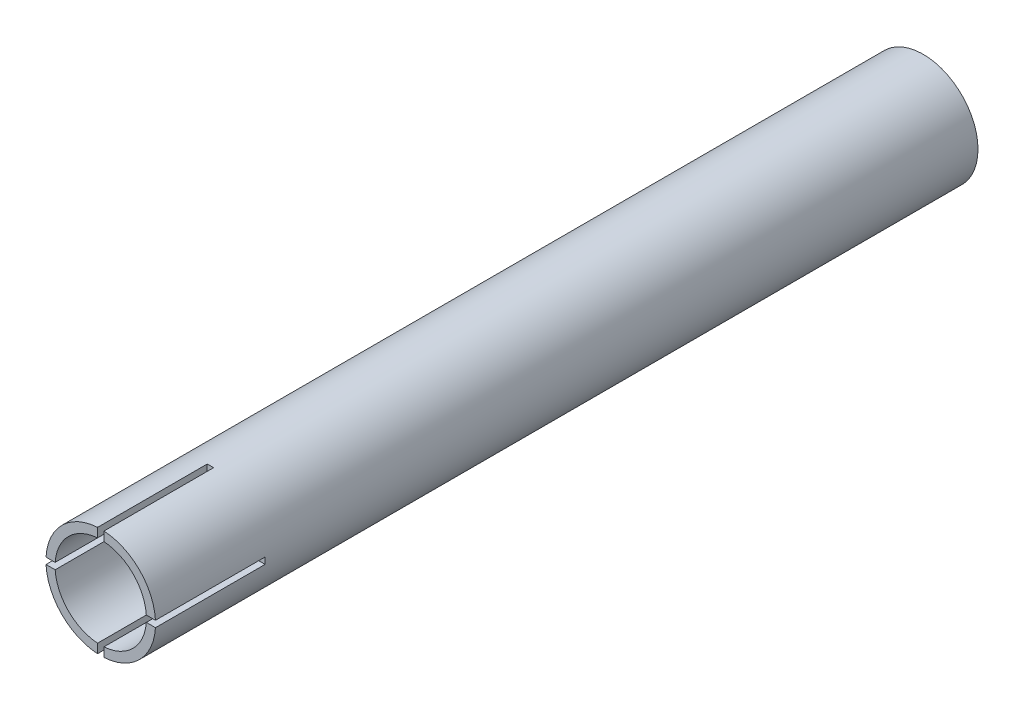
ISO-10303-21;
HEADER;
FILE_DESCRIPTION(('STEP AP214'),'2;1');
FILE_NAME('part.step','',(''),(''),'','','');
FILE_SCHEMA(('AUTOMOTIVE_DESIGN { 1 0 10303 214 1 1 1 1 }'));
ENDSEC;
DATA;
#1=APPLICATION_CONTEXT('core data for automotive mechanical design processes');
#2=APPLICATION_PROTOCOL_DEFINITION('international standard','automotive_design',2000,#1);
#3=PRODUCT_CONTEXT('',#1,'mechanical');
#4=PRODUCT('Part','Part','',(#3));
#5=PRODUCT_RELATED_PRODUCT_CATEGORY('part','',(#4));
#6=PRODUCT_DEFINITION_FORMATION('','',#4);
#7=PRODUCT_DEFINITION_CONTEXT('part definition',#1,'design');
#8=PRODUCT_DEFINITION('design','',#6,#7);
#9=PRODUCT_DEFINITION_SHAPE('','',#8);
#10=(LENGTH_UNIT() NAMED_UNIT(*) SI_UNIT(.MILLI.,.METRE.));
#11=(NAMED_UNIT(*) PLANE_ANGLE_UNIT() SI_UNIT($,.RADIAN.));
#12=(NAMED_UNIT(*) SI_UNIT($,.STERADIAN.) SOLID_ANGLE_UNIT());
#13=UNCERTAINTY_MEASURE_WITH_UNIT(LENGTH_MEASURE(1.E-05),#10,'distance_accuracy_value','');
#14=(GEOMETRIC_REPRESENTATION_CONTEXT(3) GLOBAL_UNCERTAINTY_ASSIGNED_CONTEXT((#13)) GLOBAL_UNIT_ASSIGNED_CONTEXT((#10,
#11,#12)) REPRESENTATION_CONTEXT('',''));
#15=CARTESIAN_POINT('',(0.,0.,0.));
#16=DIRECTION('',(0.,0.,1.));
#17=DIRECTION('',(1.,0.,0.));
#18=AXIS2_PLACEMENT_3D('',#15,#16,#17);
#19=CARTESIAN_POINT('',(0.,0.,90.));
#20=DIRECTION('',(0.,0.,1.));
#21=DIRECTION('',(1.,0.,0.));
#22=AXIS2_PLACEMENT_3D('',#19,#20,#21);
#23=PLANE('',#22);
#24=DIRECTION('',(0.,1.,0.));
#25=VECTOR('',#24,1.);
#26=CARTESIAN_POINT('',(0.350000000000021,6.04127326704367,90.));
#27=LINE('',#26,#25);
#28=CARTESIAN_POINT('',(0.350000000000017,4.98773495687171,90.));
#29=VERTEX_POINT('',#28);
#30=CARTESIAN_POINT('',(0.350000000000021,5.98978296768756,90.));
#31=VERTEX_POINT('',#30);
#32=EDGE_CURVE('E175',#29,#31,#27,.T.);
#33=ORIENTED_EDGE('',*,*,#32,.F.);
#34=CARTESIAN_POINT('',(0.,0.,90.));
#35=DIRECTION('',(0.,0.,1.));
#36=DIRECTION('',(1.,0.,0.));
#37=AXIS2_PLACEMENT_3D('',#34,#35,#36);
#38=CIRCLE('',#37,5.);
#39=CARTESIAN_POINT('',(4.98773495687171,0.35,90.));
#40=VERTEX_POINT('',#39);
#41=EDGE_CURVE('E294',#40,#29,#38,.T.);
#42=ORIENTED_EDGE('',*,*,#41,.F.);
#43=DIRECTION('',(-1.,0.,0.));
#44=VECTOR('',#43,1.);
#45=CARTESIAN_POINT('',(6.04127326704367,0.35,90.));
#46=LINE('',#45,#44);
#47=CARTESIAN_POINT('',(5.98978296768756,0.35,90.));
#48=VERTEX_POINT('',#47);
#49=EDGE_CURVE('E195',#48,#40,#46,.T.);
#50=ORIENTED_EDGE('',*,*,#49,.F.);
#51=CARTESIAN_POINT('',(0.,0.,90.));
#52=DIRECTION('',(0.,0.,1.));
#53=DIRECTION('',(1.,0.,0.));
#54=AXIS2_PLACEMENT_3D('',#51,#52,#53);
#55=CIRCLE('',#54,6.);
#56=EDGE_CURVE('E267',#48,#31,#55,.T.);
#57=ORIENTED_EDGE('',*,*,#56,.T.);
#58=EDGE_LOOP('',(#33,#42,#50,#57));
#59=FACE_BOUND('',#58,.T.);
#60=ADVANCED_FACE('F38',(#59),#23,.T.);
#61=DIRECTION('',(1.,0.,0.));
#62=VECTOR('',#61,1.);
#63=CARTESIAN_POINT('',(6.04127326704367,-0.35,90.));
#64=LINE('',#63,#62);
#65=CARTESIAN_POINT('',(4.98773495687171,-0.35,90.));
#66=VERTEX_POINT('',#65);
#67=CARTESIAN_POINT('',(5.98978296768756,-0.35,90.));
#68=VERTEX_POINT('',#67);
#69=EDGE_CURVE('E203',#66,#68,#64,.T.);
#70=ORIENTED_EDGE('',*,*,#69,.F.);
#71=CARTESIAN_POINT('',(0.349999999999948,-4.98773495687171,90.));
#72=VERTEX_POINT('',#71);
#73=EDGE_CURVE('E259',#72,#66,#38,.T.);
#74=ORIENTED_EDGE('',*,*,#73,.F.);
#75=DIRECTION('',(0.,1.,0.));
#76=VECTOR('',#75,1.);
#77=CARTESIAN_POINT('',(0.349999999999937,-6.04127326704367,90.));
#78=LINE('',#77,#76);
#79=CARTESIAN_POINT('',(0.349999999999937,-5.98978296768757,90.));
#80=VERTEX_POINT('',#79);
#81=EDGE_CURVE('E217',#80,#72,#78,.T.);
#82=ORIENTED_EDGE('',*,*,#81,.F.);
#83=EDGE_CURVE('E264',#80,#68,#55,.T.);
#84=ORIENTED_EDGE('',*,*,#83,.T.);
#85=EDGE_LOOP('',(#70,#74,#82,#84));
#86=FACE_BOUND('',#85,.T.);
#87=ADVANCED_FACE('F280',(#86),#23,.T.);
#88=DIRECTION('',(0.,-1.,0.));
#89=VECTOR('',#88,1.);
#90=CARTESIAN_POINT('',(-0.350000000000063,-6.04127326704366,90.));
#91=LINE('',#90,#89);
#92=CARTESIAN_POINT('',(-0.350000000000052,-4.9877349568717,90.));
#93=VERTEX_POINT('',#92);
#94=CARTESIAN_POINT('',(-0.350000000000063,-5.98978296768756,90.));
#95=VERTEX_POINT('',#94);
#96=EDGE_CURVE('E227',#93,#95,#91,.T.);
#97=ORIENTED_EDGE('',*,*,#96,.F.);
#98=CARTESIAN_POINT('',(-4.98773495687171,-0.35,90.));
#99=VERTEX_POINT('',#98);
#100=EDGE_CURVE('E255',#99,#93,#38,.T.);
#101=ORIENTED_EDGE('',*,*,#100,.F.);
#102=DIRECTION('',(1.,0.,0.));
#103=VECTOR('',#102,1.);
#104=CARTESIAN_POINT('',(-6.04127326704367,-0.35,90.));
#105=LINE('',#104,#103);
#106=CARTESIAN_POINT('',(-5.98978296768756,-0.35,90.));
#107=VERTEX_POINT('',#106);
#108=EDGE_CURVE('E184',#107,#99,#105,.T.);
#109=ORIENTED_EDGE('',*,*,#108,.F.);
#110=EDGE_CURVE('E46',#107,#95,#55,.T.);
#111=ORIENTED_EDGE('',*,*,#110,.T.);
#112=EDGE_LOOP('',(#97,#101,#109,#111));
#113=FACE_BOUND('',#112,.T.);
#114=ADVANCED_FACE('F305',(#113),#23,.T.);
#115=DIRECTION('',(0.,-1.,0.));
#116=VECTOR('',#115,1.);
#117=CARTESIAN_POINT('',(-0.349999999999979,6.04127326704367,90.));
#118=LINE('',#117,#116);
#119=CARTESIAN_POINT('',(-0.349999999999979,5.98978296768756,90.));
#120=VERTEX_POINT('',#119);
#121=CARTESIAN_POINT('',(-0.349999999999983,4.98773495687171,90.));
#122=VERTEX_POINT('',#121);
#123=EDGE_CURVE('E177',#120,#122,#118,.T.);
#124=ORIENTED_EDGE('',*,*,#123,.F.);
#125=CARTESIAN_POINT('',(-5.98978296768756,0.35,90.));
#126=VERTEX_POINT('',#125);
#127=EDGE_CURVE('E172',#120,#126,#55,.T.);
#128=ORIENTED_EDGE('',*,*,#127,.T.);
#129=DIRECTION('',(-1.,0.,0.));
#130=VECTOR('',#129,1.);
#131=CARTESIAN_POINT('',(-6.04127326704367,0.35,90.));
#132=LINE('',#131,#130);
#133=CARTESIAN_POINT('',(-4.98773495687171,0.35,90.));
#134=VERTEX_POINT('',#133);
#135=EDGE_CURVE('E235',#134,#126,#132,.T.);
#136=ORIENTED_EDGE('',*,*,#135,.F.);
#137=EDGE_CURVE('E260',#122,#134,#38,.T.);
#138=ORIENTED_EDGE('',*,*,#137,.F.);
#139=EDGE_LOOP('',(#124,#128,#136,#138));
#140=FACE_BOUND('',#139,.T.);
#141=ADVANCED_FACE('F302',(#140),#23,.T.);
#142=CARTESIAN_POINT('',(0.,0.,0.));
#143=DIRECTION('',(0.,0.,1.));
#144=DIRECTION('',(1.,0.,0.));
#145=AXIS2_PLACEMENT_3D('',#142,#143,#144);
#146=PLANE('',#145);
#147=CARTESIAN_POINT('',(0.,0.,0.));
#148=DIRECTION('',(0.,0.,1.));
#149=DIRECTION('',(1.,0.,0.));
#150=AXIS2_PLACEMENT_3D('',#147,#148,#149);
#151=CIRCLE('',#150,6.);
#152=CARTESIAN_POINT('',(6.,0.,0.));
#153=VERTEX_POINT('',#152);
#154=EDGE_CURVE('E258',#153,#153,#151,.T.);
#155=ORIENTED_EDGE('',*,*,#154,.F.);
#156=EDGE_LOOP('',(#155));
#157=FACE_BOUND('',#156,.T.);
#158=CARTESIAN_POINT('',(0.,0.,0.));
#159=DIRECTION('',(0.,0.,1.));
#160=DIRECTION('',(1.,0.,0.));
#161=AXIS2_PLACEMENT_3D('',#158,#159,#160);
#162=CIRCLE('',#161,5.);
#163=CARTESIAN_POINT('',(5.,0.,0.));
#164=VERTEX_POINT('',#163);
#165=EDGE_CURVE('E254',#164,#164,#162,.T.);
#166=ORIENTED_EDGE('',*,*,#165,.T.);
#167=EDGE_LOOP('',(#166));
#168=FACE_BOUND('',#167,.T.);
#169=ADVANCED_FACE('F304',(#157,#168),#146,.F.);
#170=CARTESIAN_POINT('',(0.,0.,90.));
#171=DIRECTION('',(0.,0.,-1.));
#172=DIRECTION('',(-1.,0.,0.));
#173=AXIS2_PLACEMENT_3D('',#170,#171,#172);
#174=CYLINDRICAL_SURFACE('',#173,6.);
#175=CARTESIAN_POINT('',(0.,0.,78.));
#176=DIRECTION('',(0.,0.,1.));
#177=DIRECTION('',(0.,-1.,0.));
#178=AXIS2_PLACEMENT_3D('',#175,#176,#177);
#179=CIRCLE('',#178,6.);
#180=CARTESIAN_POINT('',(0.350000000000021,5.98978296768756,78.));
#181=VERTEX_POINT('',#180);
#182=CARTESIAN_POINT('',(-0.349999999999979,5.98978296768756,78.));
#183=VERTEX_POINT('',#182);
#184=EDGE_CURVE('E152',#181,#183,#179,.T.);
#185=ORIENTED_EDGE('',*,*,#184,.F.);
#186=DIRECTION('',(0.,0.,-1.));
#187=VECTOR('',#186,1.);
#188=CARTESIAN_POINT('',(0.350000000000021,5.98978296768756,90.));
#189=LINE('',#188,#187);
#190=EDGE_CURVE('E182',#181,#31,#189,.F.);
#191=ORIENTED_EDGE('',*,*,#190,.T.);
#192=ORIENTED_EDGE('',*,*,#56,.F.);
#193=DIRECTION('',(0.,0.,-1.));
#194=VECTOR('',#193,1.);
#195=CARTESIAN_POINT('',(5.98978296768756,0.35,90.));
#196=LINE('',#195,#194);
#197=CARTESIAN_POINT('',(5.98978296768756,0.35,78.));
#198=VERTEX_POINT('',#197);
#199=EDGE_CURVE('E198',#48,#198,#196,.T.);
#200=ORIENTED_EDGE('',*,*,#199,.T.);
#201=CARTESIAN_POINT('',(0.,0.,78.));
#202=DIRECTION('',(0.,0.,1.));
#203=DIRECTION('',(-1.,0.,0.));
#204=AXIS2_PLACEMENT_3D('',#201,#202,#203);
#205=CIRCLE('',#204,6.);
#206=CARTESIAN_POINT('',(5.98978296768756,-0.35,78.));
#207=VERTEX_POINT('',#206);
#208=EDGE_CURVE('E185',#207,#198,#205,.T.);
#209=ORIENTED_EDGE('',*,*,#208,.F.);
#210=DIRECTION('',(0.,0.,-1.));
#211=VECTOR('',#210,1.);
#212=CARTESIAN_POINT('',(5.98978296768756,-0.35,90.));
#213=LINE('',#212,#211);
#214=EDGE_CURVE('E162',#207,#68,#213,.F.);
#215=ORIENTED_EDGE('',*,*,#214,.T.);
#216=ORIENTED_EDGE('',*,*,#83,.F.);
#217=DIRECTION('',(0.,0.,-1.));
#218=VECTOR('',#217,1.);
#219=CARTESIAN_POINT('',(0.349999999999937,-5.98978296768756,90.));
#220=LINE('',#219,#218);
#221=CARTESIAN_POINT('',(0.349999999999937,-5.98978296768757,78.));
#222=VERTEX_POINT('',#221);
#223=EDGE_CURVE('E222',#80,#222,#220,.T.);
#224=ORIENTED_EDGE('',*,*,#223,.T.);
#225=CARTESIAN_POINT('',(0.,0.,78.));
#226=DIRECTION('',(0.,0.,1.));
#227=DIRECTION('',(0.,1.,0.));
#228=AXIS2_PLACEMENT_3D('',#225,#226,#227);
#229=CIRCLE('',#228,6.);
#230=CARTESIAN_POINT('',(-0.350000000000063,-5.98978296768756,78.));
#231=VERTEX_POINT('',#230);
#232=EDGE_CURVE('E207',#231,#222,#229,.T.);
#233=ORIENTED_EDGE('',*,*,#232,.F.);
#234=DIRECTION('',(0.,0.,-1.));
#235=VECTOR('',#234,1.);
#236=CARTESIAN_POINT('',(-0.350000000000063,-5.98978296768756,90.));
#237=LINE('',#236,#235);
#238=EDGE_CURVE('E188',#231,#95,#237,.F.);
#239=ORIENTED_EDGE('',*,*,#238,.T.);
#240=ORIENTED_EDGE('',*,*,#110,.F.);
#241=DIRECTION('',(0.,0.,-1.));
#242=VECTOR('',#241,1.);
#243=CARTESIAN_POINT('',(-5.98978296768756,-0.35,90.));
#244=LINE('',#243,#242);
#245=CARTESIAN_POINT('',(-5.98978296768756,-0.35,78.));
#246=VERTEX_POINT('',#245);
#247=EDGE_CURVE('E249',#107,#246,#244,.T.);
#248=ORIENTED_EDGE('',*,*,#247,.T.);
#249=CARTESIAN_POINT('',(0.,0.,78.));
#250=DIRECTION('',(0.,0.,1.));
#251=DIRECTION('',(1.,0.,0.));
#252=AXIS2_PLACEMENT_3D('',#249,#250,#251);
#253=CIRCLE('',#252,6.);
#254=CARTESIAN_POINT('',(-5.98978296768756,0.35,78.));
#255=VERTEX_POINT('',#254);
#256=EDGE_CURVE('E245',#255,#246,#253,.T.);
#257=ORIENTED_EDGE('',*,*,#256,.F.);
#258=DIRECTION('',(0.,0.,-1.));
#259=VECTOR('',#258,1.);
#260=CARTESIAN_POINT('',(-5.98978296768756,0.35,90.));
#261=LINE('',#260,#259);
#262=EDGE_CURVE('E252',#255,#126,#261,.F.);
#263=ORIENTED_EDGE('',*,*,#262,.T.);
#264=ORIENTED_EDGE('',*,*,#127,.F.);
#265=DIRECTION('',(0.,0.,-1.));
#266=VECTOR('',#265,1.);
#267=CARTESIAN_POINT('',(-0.349999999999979,5.98978296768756,90.));
#268=LINE('',#267,#266);
#269=EDGE_CURVE('E165',#120,#183,#268,.T.);
#270=ORIENTED_EDGE('',*,*,#269,.T.);
#271=EDGE_LOOP('',(#185,#191,#192,#200,#209,#215,#216,#224,#233,#239,#240,#248,#257,#263,#264,#270));
#272=FACE_BOUND('',#271,.T.);
#273=ORIENTED_EDGE('',*,*,#154,.T.);
#274=EDGE_LOOP('',(#273));
#275=FACE_BOUND('',#274,.T.);
#276=ADVANCED_FACE('F40',(#272,#275),#174,.T.);
#277=CARTESIAN_POINT('',(0.,0.,90.));
#278=DIRECTION('',(0.,0.,-1.));
#279=DIRECTION('',(-1.,0.,0.));
#280=AXIS2_PLACEMENT_3D('',#277,#278,#279);
#281=CYLINDRICAL_SURFACE('',#280,5.);
#282=DIRECTION('',(0.,0.,1.));
#283=VECTOR('',#282,1.);
#284=CARTESIAN_POINT('',(0.350000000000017,4.98773495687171,78.));
#285=LINE('',#284,#283);
#286=CARTESIAN_POINT('',(0.350000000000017,4.98773495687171,78.));
#287=VERTEX_POINT('',#286);
#288=EDGE_CURVE('E173',#287,#29,#285,.T.);
#289=ORIENTED_EDGE('',*,*,#288,.F.);
#290=CARTESIAN_POINT('',(0.,0.,78.));
#291=DIRECTION('',(0.,0.,1.));
#292=DIRECTION('',(0.,-1.,0.));
#293=AXIS2_PLACEMENT_3D('',#290,#291,#292);
#294=CIRCLE('',#293,5.);
#295=CARTESIAN_POINT('',(-0.349999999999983,4.98773495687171,78.));
#296=VERTEX_POINT('',#295);
#297=EDGE_CURVE('E167',#287,#296,#294,.T.);
#298=ORIENTED_EDGE('',*,*,#297,.T.);
#299=DIRECTION('',(0.,0.,1.));
#300=VECTOR('',#299,1.);
#301=CARTESIAN_POINT('',(-0.349999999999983,4.98773495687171,78.));
#302=LINE('',#301,#300);
#303=EDGE_CURVE('E53',#296,#122,#302,.T.);
#304=ORIENTED_EDGE('',*,*,#303,.T.);
#305=ORIENTED_EDGE('',*,*,#137,.T.);
#306=DIRECTION('',(0.,0.,1.));
#307=VECTOR('',#306,1.);
#308=CARTESIAN_POINT('',(-4.98773495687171,0.35,78.));
#309=LINE('',#308,#307);
#310=CARTESIAN_POINT('',(-4.98773495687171,0.35,78.));
#311=VERTEX_POINT('',#310);
#312=EDGE_CURVE('E242',#311,#134,#309,.T.);
#313=ORIENTED_EDGE('',*,*,#312,.F.);
#314=CARTESIAN_POINT('',(0.,0.,78.));
#315=DIRECTION('',(0.,0.,1.));
#316=DIRECTION('',(1.,0.,0.));
#317=AXIS2_PLACEMENT_3D('',#314,#315,#316);
#318=CIRCLE('',#317,5.);
#319=CARTESIAN_POINT('',(-4.98773495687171,-0.35,78.));
#320=VERTEX_POINT('',#319);
#321=EDGE_CURVE('E12',#311,#320,#318,.T.);
#322=ORIENTED_EDGE('',*,*,#321,.T.);
#323=DIRECTION('',(0.,0.,1.));
#324=VECTOR('',#323,1.);
#325=CARTESIAN_POINT('',(-4.98773495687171,-0.35,78.));
#326=LINE('',#325,#324);
#327=EDGE_CURVE('E238',#320,#99,#326,.T.);
#328=ORIENTED_EDGE('',*,*,#327,.T.);
#329=ORIENTED_EDGE('',*,*,#100,.T.);
#330=DIRECTION('',(0.,0.,1.));
#331=VECTOR('',#330,1.);
#332=CARTESIAN_POINT('',(-0.350000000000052,-4.9877349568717,78.));
#333=LINE('',#332,#331);
#334=CARTESIAN_POINT('',(-0.350000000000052,-4.9877349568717,78.));
#335=VERTEX_POINT('',#334);
#336=EDGE_CURVE('E225',#335,#93,#333,.T.);
#337=ORIENTED_EDGE('',*,*,#336,.F.);
#338=CARTESIAN_POINT('',(0.,0.,78.));
#339=DIRECTION('',(0.,0.,1.));
#340=DIRECTION('',(0.,1.,0.));
#341=AXIS2_PLACEMENT_3D('',#338,#339,#340);
#342=CIRCLE('',#341,5.);
#343=CARTESIAN_POINT('',(0.349999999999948,-4.98773495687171,78.));
#344=VERTEX_POINT('',#343);
#345=EDGE_CURVE('E212',#335,#344,#342,.T.);
#346=ORIENTED_EDGE('',*,*,#345,.T.);
#347=DIRECTION('',(0.,0.,1.));
#348=VECTOR('',#347,1.);
#349=CARTESIAN_POINT('',(0.349999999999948,-4.98773495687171,78.));
#350=LINE('',#349,#348);
#351=EDGE_CURVE('E219',#344,#72,#350,.T.);
#352=ORIENTED_EDGE('',*,*,#351,.T.);
#353=ORIENTED_EDGE('',*,*,#73,.T.);
#354=DIRECTION('',(0.,0.,1.));
#355=VECTOR('',#354,1.);
#356=CARTESIAN_POINT('',(4.98773495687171,-0.35,78.));
#357=LINE('',#356,#355);
#358=CARTESIAN_POINT('',(4.98773495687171,-0.35,78.));
#359=VERTEX_POINT('',#358);
#360=EDGE_CURVE('E201',#359,#66,#357,.T.);
#361=ORIENTED_EDGE('',*,*,#360,.F.);
#362=CARTESIAN_POINT('',(0.,0.,78.));
#363=DIRECTION('',(0.,0.,1.));
#364=DIRECTION('',(-1.,0.,0.));
#365=AXIS2_PLACEMENT_3D('',#362,#363,#364);
#366=CIRCLE('',#365,5.);
#367=CARTESIAN_POINT('',(4.98773495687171,0.35,78.));
#368=VERTEX_POINT('',#367);
#369=EDGE_CURVE('E190',#359,#368,#366,.T.);
#370=ORIENTED_EDGE('',*,*,#369,.T.);
#371=DIRECTION('',(0.,0.,1.));
#372=VECTOR('',#371,1.);
#373=CARTESIAN_POINT('',(4.98773495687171,0.35,78.));
#374=LINE('',#373,#372);
#375=EDGE_CURVE('E61',#368,#40,#374,.T.);
#376=ORIENTED_EDGE('',*,*,#375,.T.);
#377=ORIENTED_EDGE('',*,*,#41,.T.);
#378=EDGE_LOOP('',(#289,#298,#304,#305,#313,#322,#328,#329,#337,#346,#352,#353,#361,#370,#376,#377));
#379=FACE_BOUND('',#378,.T.);
#380=ORIENTED_EDGE('',*,*,#165,.F.);
#381=EDGE_LOOP('',(#380));
#382=FACE_BOUND('',#381,.T.);
#383=ADVANCED_FACE('F292',(#379,#382),#281,.F.);
#384=CARTESIAN_POINT('',(-6.04127326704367,0.35,78.));
#385=DIRECTION('',(0.,1.,0.));
#386=DIRECTION('',(0.,0.,1.));
#387=AXIS2_PLACEMENT_3D('',#384,#385,#386);
#388=PLANE('',#387);
#389=DIRECTION('',(-1.,0.,0.));
#390=VECTOR('',#389,1.);
#391=CARTESIAN_POINT('',(-6.04127326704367,0.35,78.));
#392=LINE('',#391,#390);
#393=EDGE_CURVE('E234',#311,#255,#392,.T.);
#394=ORIENTED_EDGE('',*,*,#393,.F.);
#395=ORIENTED_EDGE('',*,*,#312,.T.);
#396=ORIENTED_EDGE('',*,*,#135,.T.);
#397=ORIENTED_EDGE('',*,*,#262,.F.);
#398=EDGE_LOOP('',(#394,#395,#396,#397));
#399=FACE_BOUND('',#398,.T.);
#400=ADVANCED_FACE('F301',(#399),#388,.F.);
#401=CARTESIAN_POINT('',(-6.04127326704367,-0.35,78.));
#402=DIRECTION('',(0.,-1.,0.));
#403=DIRECTION('',(0.,0.,-1.));
#404=AXIS2_PLACEMENT_3D('',#401,#402,#403);
#405=PLANE('',#404);
#406=ORIENTED_EDGE('',*,*,#108,.T.);
#407=ORIENTED_EDGE('',*,*,#327,.F.);
#408=DIRECTION('',(1.,0.,0.));
#409=VECTOR('',#408,1.);
#410=CARTESIAN_POINT('',(-6.04127326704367,-0.35,78.));
#411=LINE('',#410,#409);
#412=EDGE_CURVE('E231',#246,#320,#411,.T.);
#413=ORIENTED_EDGE('',*,*,#412,.F.);
#414=ORIENTED_EDGE('',*,*,#247,.F.);
#415=EDGE_LOOP('',(#406,#407,#413,#414));
#416=FACE_BOUND('',#415,.T.);
#417=ADVANCED_FACE('F350',(#416),#405,.F.);
#418=CARTESIAN_POINT('',(0.,0.,78.));
#419=DIRECTION('',(0.,0.,1.));
#420=DIRECTION('',(1.,0.,0.));
#421=AXIS2_PLACEMENT_3D('',#418,#419,#420);
#422=PLANE('',#421);
#423=ORIENTED_EDGE('',*,*,#256,.T.);
#424=ORIENTED_EDGE('',*,*,#412,.T.);
#425=ORIENTED_EDGE('',*,*,#321,.F.);
#426=ORIENTED_EDGE('',*,*,#393,.T.);
#427=EDGE_LOOP('',(#423,#424,#425,#426));
#428=FACE_BOUND('',#427,.T.);
#429=ADVANCED_FACE('F346',(#428),#422,.T.);
#430=CARTESIAN_POINT('',(-0.350000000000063,-6.04127326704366,78.));
#431=DIRECTION('',(-1.,0.,0.));
#432=DIRECTION('',(0.,0.,1.));
#433=AXIS2_PLACEMENT_3D('',#430,#431,#432);
#434=PLANE('',#433);
#435=DIRECTION('',(0.,-1.,0.));
#436=VECTOR('',#435,1.);
#437=CARTESIAN_POINT('',(-0.350000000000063,-6.04127326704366,78.));
#438=LINE('',#437,#436);
#439=EDGE_CURVE('E215',#335,#231,#438,.T.);
#440=ORIENTED_EDGE('',*,*,#439,.F.);
#441=ORIENTED_EDGE('',*,*,#336,.T.);
#442=ORIENTED_EDGE('',*,*,#96,.T.);
#443=ORIENTED_EDGE('',*,*,#238,.F.);
#444=EDGE_LOOP('',(#440,#441,#442,#443));
#445=FACE_BOUND('',#444,.T.);
#446=ADVANCED_FACE('F342',(#445),#434,.F.);
#447=CARTESIAN_POINT('',(0.349999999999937,-6.04127326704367,78.));
#448=DIRECTION('',(1.,0.,0.));
#449=DIRECTION('',(0.,0.,-1.));
#450=AXIS2_PLACEMENT_3D('',#447,#448,#449);
#451=PLANE('',#450);
#452=ORIENTED_EDGE('',*,*,#81,.T.);
#453=ORIENTED_EDGE('',*,*,#351,.F.);
#454=DIRECTION('',(0.,1.,0.));
#455=VECTOR('',#454,1.);
#456=CARTESIAN_POINT('',(0.349999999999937,-6.04127326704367,78.));
#457=LINE('',#456,#455);
#458=EDGE_CURVE('E209',#222,#344,#457,.T.);
#459=ORIENTED_EDGE('',*,*,#458,.F.);
#460=ORIENTED_EDGE('',*,*,#223,.F.);
#461=EDGE_LOOP('',(#452,#453,#459,#460));
#462=FACE_BOUND('',#461,.T.);
#463=ADVANCED_FACE('F338',(#462),#451,.F.);
#464=CARTESIAN_POINT('',(0.,0.,78.));
#465=DIRECTION('',(0.,0.,1.));
#466=DIRECTION('',(0.,1.,0.));
#467=AXIS2_PLACEMENT_3D('',#464,#465,#466);
#468=PLANE('',#467);
#469=ORIENTED_EDGE('',*,*,#232,.T.);
#470=ORIENTED_EDGE('',*,*,#458,.T.);
#471=ORIENTED_EDGE('',*,*,#345,.F.);
#472=ORIENTED_EDGE('',*,*,#439,.T.);
#473=EDGE_LOOP('',(#469,#470,#471,#472));
#474=FACE_BOUND('',#473,.T.);
#475=ADVANCED_FACE('F335',(#474),#468,.T.);
#476=CARTESIAN_POINT('',(6.04127326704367,-0.35,78.));
#477=DIRECTION('',(0.,-1.,0.));
#478=DIRECTION('',(0.,0.,1.));
#479=AXIS2_PLACEMENT_3D('',#476,#477,#478);
#480=PLANE('',#479);
#481=DIRECTION('',(1.,0.,0.));
#482=VECTOR('',#481,1.);
#483=CARTESIAN_POINT('',(6.04127326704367,-0.35,78.));
#484=LINE('',#483,#482);
#485=EDGE_CURVE('E193',#359,#207,#484,.T.);
#486=ORIENTED_EDGE('',*,*,#485,.F.);
#487=ORIENTED_EDGE('',*,*,#360,.T.);
#488=ORIENTED_EDGE('',*,*,#69,.T.);
#489=ORIENTED_EDGE('',*,*,#214,.F.);
#490=EDGE_LOOP('',(#486,#487,#488,#489));
#491=FACE_BOUND('',#490,.T.);
#492=ADVANCED_FACE('F288',(#491),#480,.F.);
#493=CARTESIAN_POINT('',(6.04127326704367,0.35,78.));
#494=DIRECTION('',(0.,1.,0.));
#495=DIRECTION('',(0.,0.,-1.));
#496=AXIS2_PLACEMENT_3D('',#493,#494,#495);
#497=PLANE('',#496);
#498=ORIENTED_EDGE('',*,*,#49,.T.);
#499=ORIENTED_EDGE('',*,*,#375,.F.);
#500=DIRECTION('',(-1.,0.,0.));
#501=VECTOR('',#500,1.);
#502=CARTESIAN_POINT('',(6.04127326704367,0.35,78.));
#503=LINE('',#502,#501);
#504=EDGE_CURVE('E187',#198,#368,#503,.T.);
#505=ORIENTED_EDGE('',*,*,#504,.F.);
#506=ORIENTED_EDGE('',*,*,#199,.F.);
#507=EDGE_LOOP('',(#498,#499,#505,#506));
#508=FACE_BOUND('',#507,.T.);
#509=ADVANCED_FACE('F320',(#508),#497,.F.);
#510=CARTESIAN_POINT('',(0.,0.,78.));
#511=DIRECTION('',(0.,0.,1.));
#512=DIRECTION('',(-1.,0.,0.));
#513=AXIS2_PLACEMENT_3D('',#510,#511,#512);
#514=PLANE('',#513);
#515=ORIENTED_EDGE('',*,*,#208,.T.);
#516=ORIENTED_EDGE('',*,*,#504,.T.);
#517=ORIENTED_EDGE('',*,*,#369,.F.);
#518=ORIENTED_EDGE('',*,*,#485,.T.);
#519=EDGE_LOOP('',(#515,#516,#517,#518));
#520=FACE_BOUND('',#519,.T.);
#521=ADVANCED_FACE('F322',(#520),#514,.T.);
#522=CARTESIAN_POINT('',(0.350000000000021,6.04127326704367,78.));
#523=DIRECTION('',(1.,0.,0.));
#524=DIRECTION('',(0.,0.,1.));
#525=AXIS2_PLACEMENT_3D('',#522,#523,#524);
#526=PLANE('',#525);
#527=DIRECTION('',(0.,1.,0.));
#528=VECTOR('',#527,1.);
#529=CARTESIAN_POINT('',(0.350000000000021,6.04127326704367,78.));
#530=LINE('',#529,#528);
#531=EDGE_CURVE('E157',#287,#181,#530,.T.);
#532=ORIENTED_EDGE('',*,*,#531,.F.);
#533=ORIENTED_EDGE('',*,*,#288,.T.);
#534=ORIENTED_EDGE('',*,*,#32,.T.);
#535=ORIENTED_EDGE('',*,*,#190,.F.);
#536=EDGE_LOOP('',(#532,#533,#534,#535));
#537=FACE_BOUND('',#536,.T.);
#538=ADVANCED_FACE('F319',(#537),#526,.F.);
#539=CARTESIAN_POINT('',(-0.349999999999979,6.04127326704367,78.));
#540=DIRECTION('',(-1.,0.,0.));
#541=DIRECTION('',(0.,0.,-1.));
#542=AXIS2_PLACEMENT_3D('',#539,#540,#541);
#543=PLANE('',#542);
#544=ORIENTED_EDGE('',*,*,#123,.T.);
#545=ORIENTED_EDGE('',*,*,#303,.F.);
#546=DIRECTION('',(0.,-1.,0.));
#547=VECTOR('',#546,1.);
#548=CARTESIAN_POINT('',(-0.349999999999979,6.04127326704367,78.));
#549=LINE('',#548,#547);
#550=EDGE_CURVE('E154',#183,#296,#549,.T.);
#551=ORIENTED_EDGE('',*,*,#550,.F.);
#552=ORIENTED_EDGE('',*,*,#269,.F.);
#553=EDGE_LOOP('',(#544,#545,#551,#552));
#554=FACE_BOUND('',#553,.T.);
#555=ADVANCED_FACE('F164',(#554),#543,.F.);
#556=CARTESIAN_POINT('',(0.,0.,78.));
#557=DIRECTION('',(0.,0.,1.));
#558=DIRECTION('',(0.,-1.,0.));
#559=AXIS2_PLACEMENT_3D('',#556,#557,#558);
#560=PLANE('',#559);
#561=ORIENTED_EDGE('',*,*,#184,.T.);
#562=ORIENTED_EDGE('',*,*,#550,.T.);
#563=ORIENTED_EDGE('',*,*,#297,.F.);
#564=ORIENTED_EDGE('',*,*,#531,.T.);
#565=EDGE_LOOP('',(#561,#562,#563,#564));
#566=FACE_BOUND('',#565,.T.);
#567=ADVANCED_FACE('F153',(#566),#560,.T.);
#568=CLOSED_SHELL('',(#60,#87,#114,#141,#169,#276,#383,#400,#417,#429,#446,#463,#475,#492,#509,
#521,#538,#555,#567));
#569=MANIFOLD_SOLID_BREP('B2',#568);
#570=ADVANCED_BREP_SHAPE_REPRESENTATION('',(#18,#569),#14);
#571=SHAPE_DEFINITION_REPRESENTATION(#9,#570);
ENDSEC;
END-ISO-10303-21;
